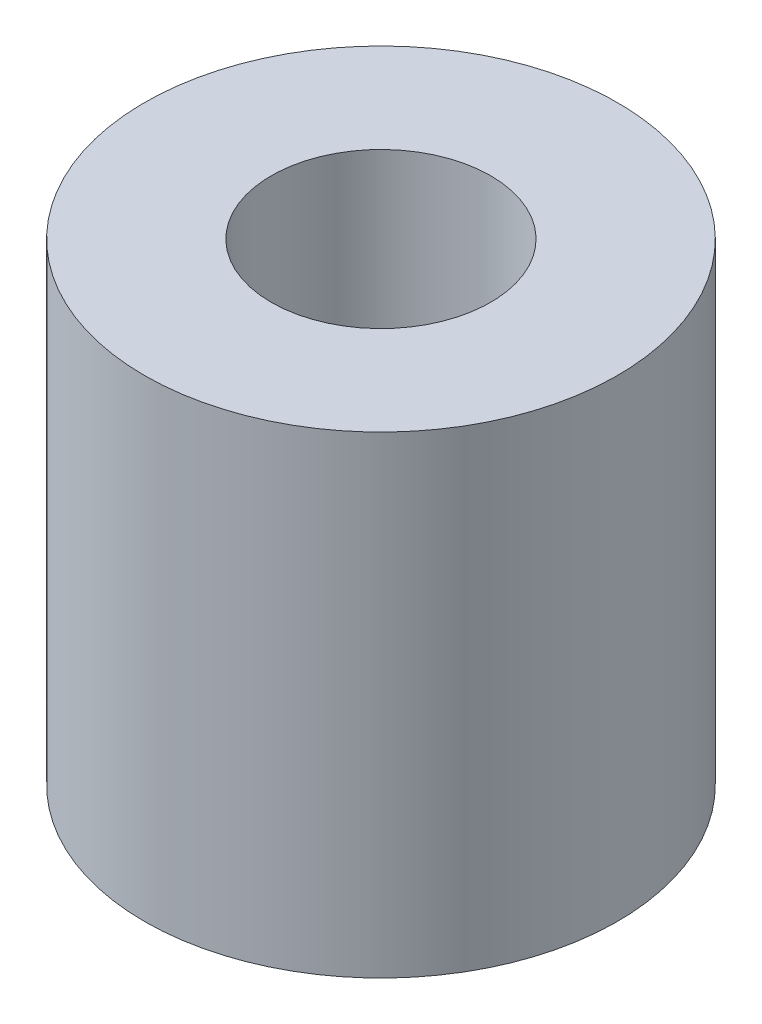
ISO-10303-21;
HEADER;
FILE_DESCRIPTION(('STEP AP214'),'2;1');
FILE_NAME('part.step','',(''),(''),'','','');
FILE_SCHEMA(('AUTOMOTIVE_DESIGN { 1 0 10303 214 1 1 1 1 }'));
ENDSEC;
DATA;
#1=APPLICATION_CONTEXT('core data for automotive mechanical design processes');
#2=APPLICATION_PROTOCOL_DEFINITION('international standard','automotive_design',2000,#1);
#3=PRODUCT_CONTEXT('',#1,'mechanical');
#4=PRODUCT('Part','Part','',(#3));
#5=PRODUCT_RELATED_PRODUCT_CATEGORY('part','',(#4));
#6=PRODUCT_DEFINITION_FORMATION('','',#4);
#7=PRODUCT_DEFINITION_CONTEXT('part definition',#1,'design');
#8=PRODUCT_DEFINITION('design','',#6,#7);
#9=PRODUCT_DEFINITION_SHAPE('','',#8);
#10=(LENGTH_UNIT() NAMED_UNIT(*) SI_UNIT(.MILLI.,.METRE.));
#11=(NAMED_UNIT(*) PLANE_ANGLE_UNIT() SI_UNIT($,.RADIAN.));
#12=(NAMED_UNIT(*) SI_UNIT($,.STERADIAN.) SOLID_ANGLE_UNIT());
#13=UNCERTAINTY_MEASURE_WITH_UNIT(LENGTH_MEASURE(1.E-05),#10,'distance_accuracy_value','');
#14=(GEOMETRIC_REPRESENTATION_CONTEXT(3) GLOBAL_UNCERTAINTY_ASSIGNED_CONTEXT((#13)) GLOBAL_UNIT_ASSIGNED_CONTEXT((#10,
#11,#12)) REPRESENTATION_CONTEXT('',''));
#15=CARTESIAN_POINT('',(0.,0.,0.));
#16=DIRECTION('',(0.,0.,1.));
#17=DIRECTION('',(1.,0.,0.));
#18=AXIS2_PLACEMENT_3D('',#15,#16,#17);
#19=CARTESIAN_POINT('',(0.,6.35,0.));
#20=DIRECTION('',(0.,1.,0.));
#21=DIRECTION('',(0.,0.,1.));
#22=AXIS2_PLACEMENT_3D('',#19,#20,#21);
#23=PLANE('',#22);
#24=CARTESIAN_POINT('',(0.,6.35,0.));
#25=DIRECTION('',(0.,1.,0.));
#26=DIRECTION('',(0.,0.,1.));
#27=AXIS2_PLACEMENT_3D('',#24,#25,#26);
#28=CIRCLE('',#27,3.175);
#29=CARTESIAN_POINT('',(0.,6.35,3.175));
#30=VERTEX_POINT('',#29);
#31=EDGE_CURVE('E10',#30,#30,#28,.T.);
#32=ORIENTED_EDGE('',*,*,#31,.T.);
#33=EDGE_LOOP('',(#32));
#34=FACE_BOUND('',#33,.T.);
#35=CARTESIAN_POINT('',(0.,6.35,0.));
#36=DIRECTION('',(0.,1.,0.));
#37=DIRECTION('',(0.,0.,1.));
#38=AXIS2_PLACEMENT_3D('',#35,#36,#37);
#39=CIRCLE('',#38,1.4732);
#40=CARTESIAN_POINT('',(0.,6.35,1.4732));
#41=VERTEX_POINT('',#40);
#42=EDGE_CURVE('E39',#41,#41,#39,.T.);
#43=ORIENTED_EDGE('',*,*,#42,.F.);
#44=EDGE_LOOP('',(#43));
#45=FACE_BOUND('',#44,.T.);
#46=ADVANCED_FACE('F28',(#34,#45),#23,.T.);
#47=CARTESIAN_POINT('',(0.,0.,0.));
#48=DIRECTION('',(0.,1.,0.));
#49=DIRECTION('',(0.,0.,1.));
#50=AXIS2_PLACEMENT_3D('',#47,#48,#49);
#51=PLANE('',#50);
#52=CARTESIAN_POINT('',(0.,0.,0.));
#53=DIRECTION('',(0.,1.,0.));
#54=DIRECTION('',(0.,0.,1.));
#55=AXIS2_PLACEMENT_3D('',#52,#53,#54);
#56=CIRCLE('',#55,3.175);
#57=CARTESIAN_POINT('',(0.,0.,3.175));
#58=VERTEX_POINT('',#57);
#59=EDGE_CURVE('E35',#58,#58,#56,.T.);
#60=ORIENTED_EDGE('',*,*,#59,.F.);
#61=EDGE_LOOP('',(#60));
#62=FACE_BOUND('',#61,.T.);
#63=CARTESIAN_POINT('',(0.,0.,0.));
#64=DIRECTION('',(0.,1.,0.));
#65=DIRECTION('',(0.,0.,1.));
#66=AXIS2_PLACEMENT_3D('',#63,#64,#65);
#67=CIRCLE('',#66,1.4732);
#68=CARTESIAN_POINT('',(0.,0.,1.4732));
#69=VERTEX_POINT('',#68);
#70=EDGE_CURVE('E43',#69,#69,#67,.T.);
#71=ORIENTED_EDGE('',*,*,#70,.T.);
#72=EDGE_LOOP('',(#71));
#73=FACE_BOUND('',#72,.T.);
#74=ADVANCED_FACE('F49',(#62,#73),#51,.F.);
#75=CARTESIAN_POINT('',(0.,6.35,0.));
#76=DIRECTION('',(0.,-1.,0.));
#77=DIRECTION('',(0.,0.,-1.));
#78=AXIS2_PLACEMENT_3D('',#75,#76,#77);
#79=CYLINDRICAL_SURFACE('',#78,3.175);
#80=ORIENTED_EDGE('',*,*,#31,.F.);
#81=EDGE_LOOP('',(#80));
#82=FACE_BOUND('',#81,.T.);
#83=ORIENTED_EDGE('',*,*,#59,.T.);
#84=EDGE_LOOP('',(#83));
#85=FACE_BOUND('',#84,.T.);
#86=ADVANCED_FACE('F30',(#82,#85),#79,.T.);
#87=CARTESIAN_POINT('',(0.,6.35,0.));
#88=DIRECTION('',(0.,-1.,0.));
#89=DIRECTION('',(0.,0.,-1.));
#90=AXIS2_PLACEMENT_3D('',#87,#88,#89);
#91=CYLINDRICAL_SURFACE('',#90,1.4732);
#92=ORIENTED_EDGE('',*,*,#42,.T.);
#93=EDGE_LOOP('',(#92));
#94=FACE_BOUND('',#93,.T.);
#95=ORIENTED_EDGE('',*,*,#70,.F.);
#96=EDGE_LOOP('',(#95));
#97=FACE_BOUND('',#96,.T.);
#98=ADVANCED_FACE('F51',(#94,#97),#91,.F.);
#99=CLOSED_SHELL('',(#46,#74,#86,#98));
#100=MANIFOLD_SOLID_BREP('B2',#99);
#101=ADVANCED_BREP_SHAPE_REPRESENTATION('',(#18,#100),#14);
#102=SHAPE_DEFINITION_REPRESENTATION(#9,#101);
ENDSEC;
END-ISO-10303-21;
